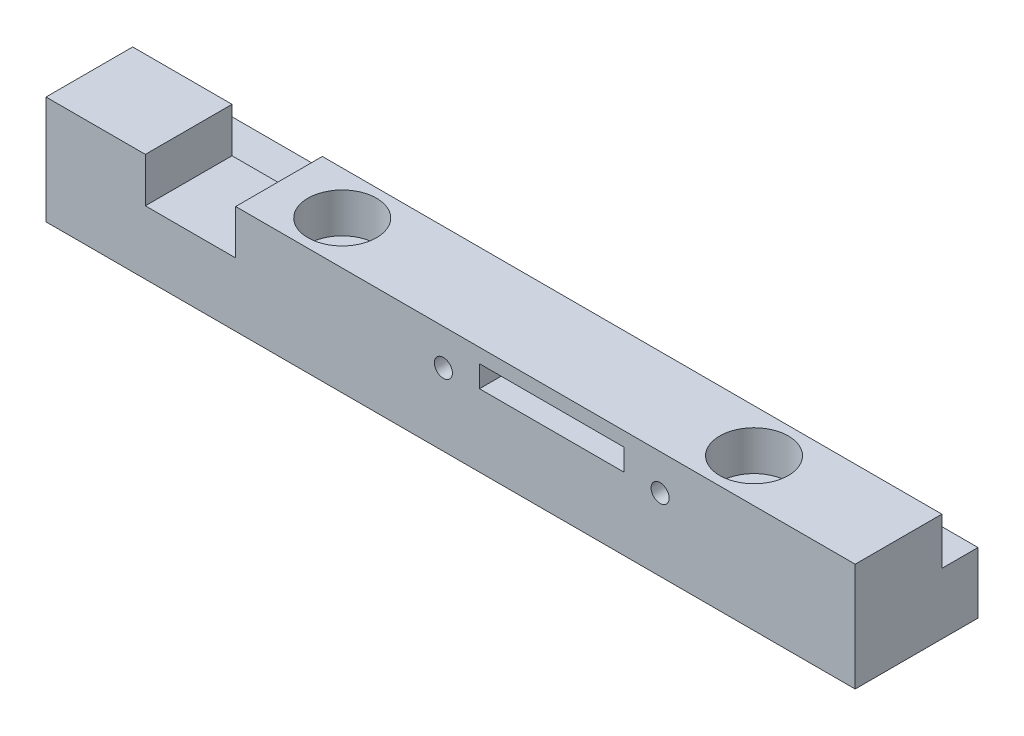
from build123d import *

# Parameters (mm, degrees)
SKETCH_1_W               = 112
SKETCH_1_H               = 15
EXTRUDE_1_DEPTH          = 17
SKETCH_2_OUTSIDE_W       = 41.854
SKETCH_2_OUTSIDE_H       = 39.854
CUT_EXTRUDE_1_DEPTH      = 112
SKETCH_3_R               = 1.25
CUT_EXTRUDE_2_DEPTH      = 8
SKETCH_4_R               = 2.75
CUT_EXTRUDE_3_DEPTH      = 115.267531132
SKETCH_5_R               = 4.75
CUT_EXTRUDE_4_DEPTH      = 5.5
SKETCH_6_W               = 20
SKETCH_6_H               = 3
CUT_EXTRUDE_5_DEPTH      = 115.267531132
CUT_EXTRUDE_6_DEPTH      = 115.267531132
CUT_EXTRUDE_6_DEPTH_BACK = 115.267531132


with BuildPart() as part:
    # Sketch 1 → Extrude 1 (new body)
    with BuildSketch(Plane.XY):
        with Locations((56, 7.5)):
            Rectangle(SKETCH_1_W, SKETCH_1_H)
    extrude(amount=EXTRUDE_1_DEPTH)

    # Sketch 2 outside → Cut-Extrude 1 (cut)
    with BuildSketch(Plane(origin=(112, 0, 0), x_dir=(0, 0, -1), z_dir=(1, 0, 0))):
        with Locations((-8.5, 7.5)):
            Rectangle(SKETCH_2_OUTSIDE_W, SKETCH_2_OUTSIDE_H)
        Polygon((-5, 8.468923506), (-5, 14.968923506), (-17, 14.968923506), (-17, -0.031076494), (0, -0.031076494), (0, 8.468923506), align=None, mode=Mode.SUBTRACT)
    extrude(amount=-CUT_EXTRUDE_1_DEPTH, mode=Mode.SUBTRACT)

    # Sketch 3 → Cut-Extrude 2 (cut)
    with BuildSketch(Plane.XY.offset(17)):
        with Locations((85, 10)):
            Circle(SKETCH_3_R)
        with Locations((55, 10)):
            Circle(SKETCH_3_R)
    extrude(amount=-CUT_EXTRUDE_2_DEPTH, mode=Mode.SUBTRACT)

    # Sketch 4 → Cut-Extrude 3 (cut, through all)
    with BuildSketch(Plane(origin=(0, 14.968923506, 0), x_dir=(1, 0, 0), z_dir=(0, 1, 0))):
        with Locations(Location((35, -11, 0), (0, 0, 270))):
            Circle(SKETCH_4_R)
        with Locations(Location((92, -11, 0), (0, 0, 270))):
            Circle(SKETCH_4_R)
    extrude(amount=-CUT_EXTRUDE_3_DEPTH, mode=Mode.SUBTRACT)

    # Sketch 5 → Cut-Extrude 4 (cut)
    with BuildSketch(Plane(origin=(0, 14.968923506, 0), x_dir=(1, 0, 0), z_dir=(0, 1, 0))):
        with Locations(Location((35, -11, 0), (0, 0, 270))):
            Circle(SKETCH_5_R)
        with Locations(Location((92, -11, 0), (0, 0, 270))):
            Circle(SKETCH_5_R)
    extrude(amount=-CUT_EXTRUDE_4_DEPTH, mode=Mode.SUBTRACT)

    # Sketch 6 → Cut-Extrude 5 (cut, through all)
    with BuildSketch(Plane.XY.offset(17)):
        with Locations((70, 11.5)):
            Rectangle(SKETCH_6_W, SKETCH_6_H)
    extrude(amount=-CUT_EXTRUDE_5_DEPTH, mode=Mode.SUBTRACT)

    # Sketch 7 → Cut-Extrude 6 (cut, two sides: drawn at the far end of the back side and taken through both)
    with BuildSketch(Plane.XY.offset(17).offset(-CUT_EXTRUDE_6_DEPTH_BACK)):
        Polygon((13.75, 223.776884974), (13.75, 15), (13.75, 8.8), (26.25, 8.8), (26.25, 15), (26.25, 223.776884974), (26.25, 641.330654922), (13.75, 641.330654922), align=None)
    extrude(amount=CUT_EXTRUDE_6_DEPTH + CUT_EXTRUDE_6_DEPTH_BACK, mode=Mode.SUBTRACT)


solid = part.part
